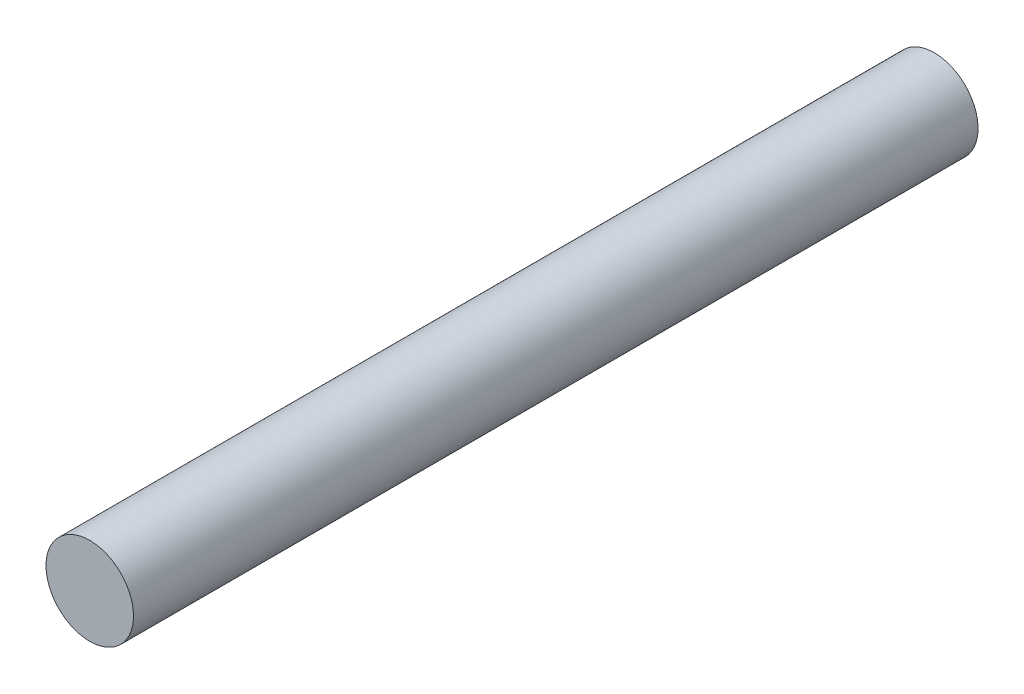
from build123d import *

# Parameters (mm, degrees)
SKETCH1_R           = 3.15
BOSS_EXTRUDE1_DEPTH = 30.4


with BuildPart() as part:
    # Sketch1 → Boss-Extrude1 (new, symmetric)
    with BuildSketch(Plane.XY):
        with Locations(Location((0, 0, 0), (0, 0, 180))):
            Circle(SKETCH1_R)
    extrude(amount=BOSS_EXTRUDE1_DEPTH, both=True)


solid = part.part
